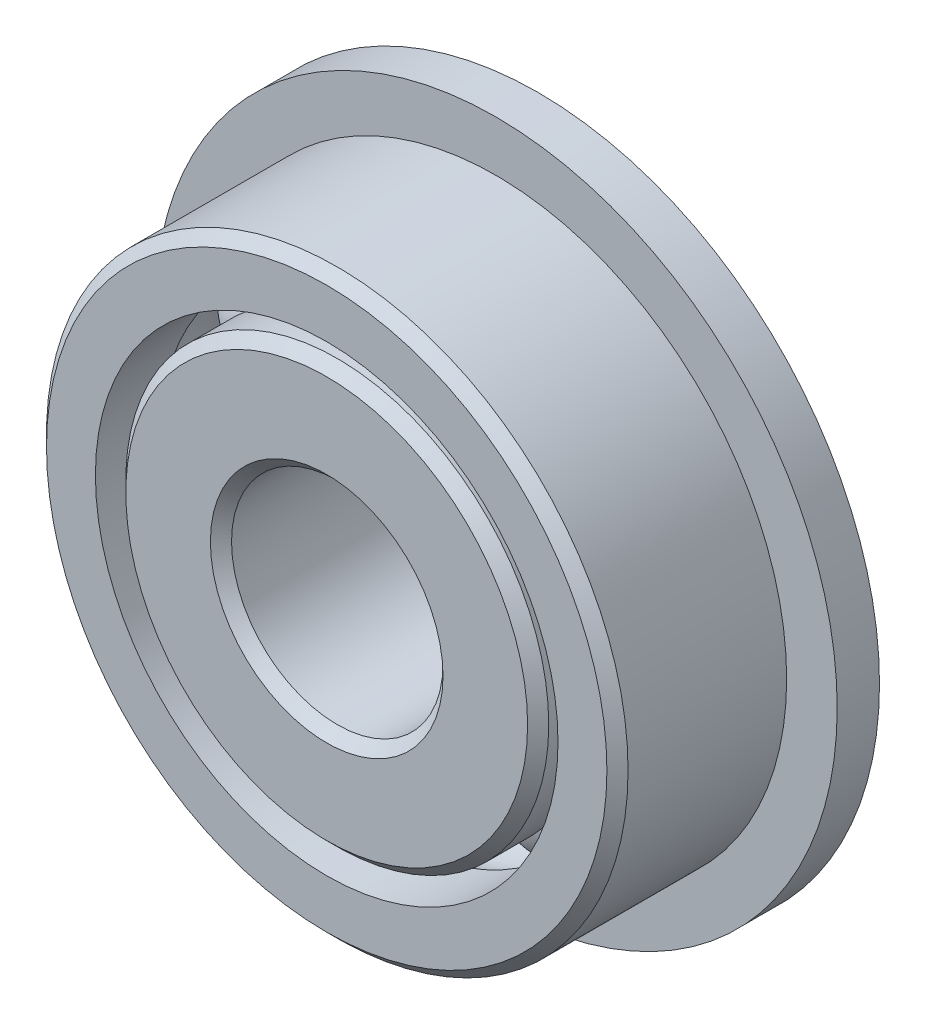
from build123d import *

# Parameters (mm, degrees)
SKETCH6_W         = 1.27
SKETCH6_H         = 3.3035875
CIRPATTERN1_COUNT = 8


with BuildPart() as part:
    # Sketch1 → Revolve1 (revolve)
    with BuildSketch(Plane(origin=(0, 0, 0), x_dir=(0, 0, -1), z_dir=(1, 0, 0)), mode=Mode.PRIVATE) as revolve1_sk:
        with BuildLine():
            Line((2.8575, 8.73125), (-2.8575, 8.73125))
            Line((-2.8575, 8.73125), (-3.175, 8.41375))
            Line((-3.175, 8.41375), (-3.175, 6.9453125))
            Line((-3.175, 6.9453125), (-1.23924179, 6.9453125))
            ThreePointArc((-1.23924179, 6.9453125), (0, 7.540625), (1.23924179, 6.9453125))
            Line((1.23924179, 6.9453125), (3.175, 6.9453125))
            Line((3.175, 6.9453125), (3.175, 8.41375))
            Line((3.175, 8.41375), (2.8575, 8.73125))
        make_face()
    revolve(revolve1_sk.sketch.rotate(Axis((0, 0, 3.175), (0, 0, -1)), 90), axis=Axis((0, 0, 3.175), (0, 0, -1)))

    # Sketch6 → Revolve6 (revolve)
    with BuildSketch(Plane(origin=(0, 0, 0), x_dir=(0, 0, -1), z_dir=(1, 0, 0)), mode=Mode.PRIVATE) as revolve6_sk:
        with Locations((2.54, 8.59710625)):
            Rectangle(SKETCH6_W, SKETCH6_H)
    revolve(revolve6_sk.sketch.rotate(Axis((0, 0, -3.175), (0, 0, 1)), 270), axis=Axis((0, 0, -3.175), (0, 0, 1)))


with BuildPart() as body_2:
    # Sketch3 → Revolve3 (revolve)
    with BuildSketch(Plane(origin=(0, 0, 0), x_dir=(0, 0, -1), z_dir=(1, 0, 0)), mode=Mode.PRIVATE) as revolve3_sk:
        with BuildLine():
            Line((-3.175, 3.4925), (-3.175, 6.0325))
            Line((-3.175, 6.0325), (-2.8575, 6.35))
            Line((-2.8575, 6.35), (-1.537090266, 6.35))
            ThreePointArc((-1.537090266, 6.35), (0, 4.365625), (1.537090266, 6.35))
            Line((1.537090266, 6.35), (4.4577, 6.35))
            Line((4.4577, 6.35), (4.7752, 6.0325))
            Line((4.7752, 6.0325), (4.7752, 3.4925))
            Line((4.7752, 3.4925), (4.4577, 3.175))
            Line((4.4577, 3.175), (-2.8575, 3.175))
            Line((-2.8575, 3.175), (-3.175, 3.4925))
        make_face()
    revolve(revolve3_sk.sketch.rotate(Axis((0, 0, 3.175), (0, 0, -1)), 90), axis=Axis((0, 0, 3.175), (0, 0, -1)))


with BuildPart() as body_3:
    # Sketch4 → Revolve4 (revolve)
    with BuildSketch(Plane(origin=(0, 0, 0), x_dir=(0, 0, -1), z_dir=(1, 0, 0))):
        with BuildLine():
            Line((-1.5875, 5.953125), (1.5875, 5.953125))
            ThreePointArc((1.5875, 5.953125), (0, 7.540625), (-1.5875, 5.953125))
        make_face()
    revolve(axis=Axis((0, 5.953125, 1.5875), (0, 0, -1)))


with BuildPart() as cirpattern1_1:
    # CirPattern1: pattern copy
    add(body_3.part.rotate(Axis((0, 0, 0), (0, 0, 1)), 1 * 360 / CIRPATTERN1_COUNT))


with BuildPart() as cirpattern1_2:
    # CirPattern1: pattern copy
    add(body_3.part.rotate(Axis((0, 0, 0), (0, 0, 1)), 2 * 360 / CIRPATTERN1_COUNT))


with BuildPart() as cirpattern1_3:
    # CirPattern1: pattern copy
    add(body_3.part.rotate(Axis((0, 0, 0), (0, 0, 1)), 3 * 360 / CIRPATTERN1_COUNT))


with BuildPart() as cirpattern1_4:
    # CirPattern1: pattern copy
    add(body_3.part.rotate(Axis((0, 0, 0), (0, 0, 1)), 4 * 360 / CIRPATTERN1_COUNT))


with BuildPart() as cirpattern1_5:
    # CirPattern1: pattern copy
    add(body_3.part.rotate(Axis((0, 0, 0), (0, 0, 1)), 5 * 360 / CIRPATTERN1_COUNT))


with BuildPart() as cirpattern1_6:
    # CirPattern1: pattern copy
    add(body_3.part.rotate(Axis((0, 0, 0), (0, 0, 1)), 6 * 360 / CIRPATTERN1_COUNT))


with BuildPart() as cirpattern1_7:
    # CirPattern1: pattern copy
    add(body_3.part.rotate(Axis((0, 0, 0), (0, 0, 1)), 7 * 360 / CIRPATTERN1_COUNT))


solid = Compound([part.part, body_2.part, body_3.part, cirpattern1_1.part, cirpattern1_2.part, cirpattern1_3.part, cirpattern1_4.part, cirpattern1_5.part, cirpattern1_6.part, cirpattern1_7.part])
